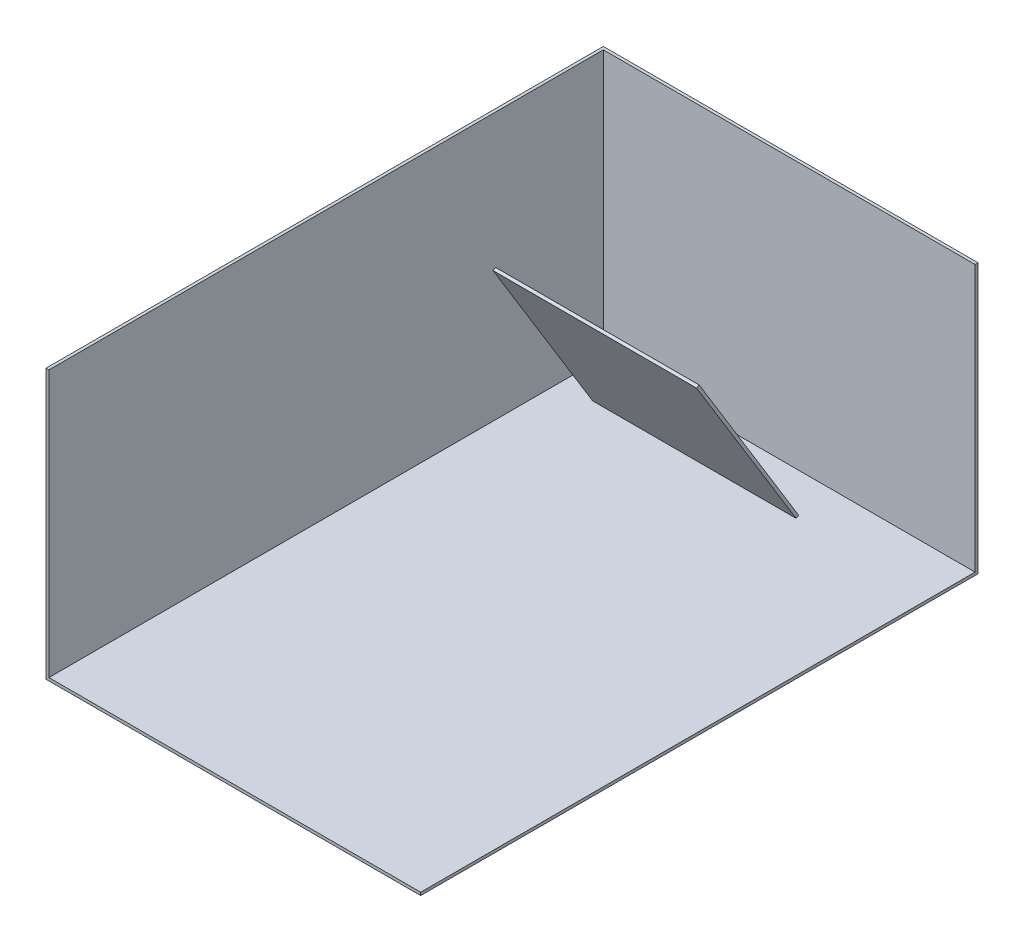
ISO-10303-21;
HEADER;
FILE_DESCRIPTION(('STEP AP214'),'2;1');
FILE_NAME('part.step','',(''),(''),'','','');
FILE_SCHEMA(('AUTOMOTIVE_DESIGN { 1 0 10303 214 1 1 1 1 }'));
ENDSEC;
DATA;
#1=APPLICATION_CONTEXT('core data for automotive mechanical design processes');
#2=APPLICATION_PROTOCOL_DEFINITION('international standard','automotive_design',2000,#1);
#3=PRODUCT_CONTEXT('',#1,'mechanical');
#4=PRODUCT('Part','Part','',(#3));
#5=PRODUCT_RELATED_PRODUCT_CATEGORY('part','',(#4));
#6=PRODUCT_DEFINITION_FORMATION('','',#4);
#7=PRODUCT_DEFINITION_CONTEXT('part definition',#1,'design');
#8=PRODUCT_DEFINITION('design','',#6,#7);
#9=PRODUCT_DEFINITION_SHAPE('','',#8);
#10=(LENGTH_UNIT() NAMED_UNIT(*) SI_UNIT(.MILLI.,.METRE.));
#11=(NAMED_UNIT(*) PLANE_ANGLE_UNIT() SI_UNIT($,.RADIAN.));
#12=(NAMED_UNIT(*) SI_UNIT($,.STERADIAN.) SOLID_ANGLE_UNIT());
#13=UNCERTAINTY_MEASURE_WITH_UNIT(LENGTH_MEASURE(1.E-05),#10,'distance_accuracy_value','');
#14=(GEOMETRIC_REPRESENTATION_CONTEXT(3) GLOBAL_UNCERTAINTY_ASSIGNED_CONTEXT((#13)) GLOBAL_UNIT_ASSIGNED_CONTEXT((#10,
#11,#12)) REPRESENTATION_CONTEXT('',''));
#15=CARTESIAN_POINT('',(0.,0.,0.));
#16=DIRECTION('',(0.,0.,1.));
#17=DIRECTION('',(1.,0.,0.));
#18=AXIS2_PLACEMENT_3D('',#15,#16,#17);
#19=CARTESIAN_POINT('',(90.0000000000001,64.823094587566,57.9064227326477));
#20=DIRECTION('',(0.,0.52215385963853,-0.852851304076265));
#21=DIRECTION('',(0.,0.852851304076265,0.52215385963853));
#22=AXIS2_PLACEMENT_3D('',#19,#20,#21);
#23=PLANE('',#22);
#24=DIRECTION('',(0.,-0.852851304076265,-0.52215385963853));
#25=VECTOR('',#24,1.);
#26=CARTESIAN_POINT('',(20.,64.823094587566,57.9064227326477));
#27=LINE('',#26,#25);
#28=CARTESIAN_POINT('',(20.,64.823094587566,57.9064227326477));
#29=VERTEX_POINT('',#28);
#30=CARTESIAN_POINT('',(20.,8.910594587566,23.6742798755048));
#31=VERTEX_POINT('',#30);
#32=EDGE_CURVE('E93',#29,#31,#27,.T.);
#33=ORIENTED_EDGE('',*,*,#32,.T.);
#34=DIRECTION('',(-1.,0.,0.));
#35=VECTOR('',#34,1.);
#36=CARTESIAN_POINT('',(90.0000000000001,8.910594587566,23.6742798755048));
#37=LINE('',#36,#35);
#38=CARTESIAN_POINT('',(90.0000000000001,8.910594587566,23.6742798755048));
#39=VERTEX_POINT('',#38);
#40=EDGE_CURVE('E12',#39,#31,#37,.T.);
#41=ORIENTED_EDGE('',*,*,#40,.F.);
#42=DIRECTION('',(0.,-0.852851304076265,-0.52215385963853));
#43=VECTOR('',#42,1.);
#44=CARTESIAN_POINT('',(90.0000000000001,64.823094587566,57.9064227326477));
#45=LINE('',#44,#43);
#46=CARTESIAN_POINT('',(90.0000000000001,64.823094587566,57.9064227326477));
#47=VERTEX_POINT('',#46);
#48=EDGE_CURVE('E104',#47,#39,#45,.T.);
#49=ORIENTED_EDGE('',*,*,#48,.F.);
#50=DIRECTION('',(-1.,0.,0.));
#51=VECTOR('',#50,1.);
#52=CARTESIAN_POINT('',(90.0000000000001,64.823094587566,57.9064227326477));
#53=LINE('',#52,#51);
#54=EDGE_CURVE('E56',#47,#29,#53,.T.);
#55=ORIENTED_EDGE('',*,*,#54,.T.);
#56=EDGE_LOOP('',(#33,#41,#49,#55));
#57=FACE_BOUND('',#56,.T.);
#58=ADVANCED_FACE('F42',(#57),#23,.F.);
#59=CARTESIAN_POINT('',(90.0000000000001,9.43274844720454,22.8214285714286));
#60=DIRECTION('',(0.,-0.852851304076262,-0.522153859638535));
#61=DIRECTION('',(0.,0.522153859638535,-0.852851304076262));
#62=AXIS2_PLACEMENT_3D('',#59,#60,#61);
#63=PLANE('',#62);
#64=DIRECTION('',(0.,-0.522153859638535,0.852851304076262));
#65=VECTOR('',#64,1.);
#66=CARTESIAN_POINT('',(20.,9.43274844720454,22.8214285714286));
#67=LINE('',#66,#65);
#68=CARTESIAN_POINT('',(20.,9.43274844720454,22.8214285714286));
#69=VERTEX_POINT('',#68);
#70=EDGE_CURVE('E87',#69,#31,#67,.T.);
#71=ORIENTED_EDGE('',*,*,#70,.F.);
#72=DIRECTION('',(-1.,0.,0.));
#73=VECTOR('',#72,1.);
#74=CARTESIAN_POINT('',(90.0000000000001,9.43274844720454,22.8214285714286));
#75=LINE('',#74,#73);
#76=CARTESIAN_POINT('',(90.0000000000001,9.43274844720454,22.8214285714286));
#77=VERTEX_POINT('',#76);
#78=EDGE_CURVE('E49',#77,#69,#75,.T.);
#79=ORIENTED_EDGE('',*,*,#78,.F.);
#80=DIRECTION('',(0.,-0.522153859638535,0.852851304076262));
#81=VECTOR('',#80,1.);
#82=CARTESIAN_POINT('',(90.0000000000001,9.43274844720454,22.8214285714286));
#83=LINE('',#82,#81);
#84=EDGE_CURVE('E90',#77,#39,#83,.T.);
#85=ORIENTED_EDGE('',*,*,#84,.T.);
#86=ORIENTED_EDGE('',*,*,#40,.T.);
#87=EDGE_LOOP('',(#71,#79,#85,#86));
#88=FACE_BOUND('',#87,.T.);
#89=ADVANCED_FACE('F85',(#88),#63,.T.);
#90=CARTESIAN_POINT('',(90.0000000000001,65.3452484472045,57.0535714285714));
#91=DIRECTION('',(0.,0.52215385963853,-0.852851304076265));
#92=DIRECTION('',(0.,0.852851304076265,0.52215385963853));
#93=AXIS2_PLACEMENT_3D('',#90,#91,#92);
#94=PLANE('',#93);
#95=DIRECTION('',(0.,-0.852851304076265,-0.52215385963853));
#96=VECTOR('',#95,1.);
#97=CARTESIAN_POINT('',(20.,65.3452484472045,57.0535714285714));
#98=LINE('',#97,#96);
#99=CARTESIAN_POINT('',(20.,65.3452484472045,57.0535714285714));
#100=VERTEX_POINT('',#99);
#101=EDGE_CURVE('E98',#100,#69,#98,.T.);
#102=ORIENTED_EDGE('',*,*,#101,.F.);
#103=DIRECTION('',(-1.,0.,0.));
#104=VECTOR('',#103,1.);
#105=CARTESIAN_POINT('',(90.0000000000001,65.3452484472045,57.0535714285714));
#106=LINE('',#105,#104);
#107=CARTESIAN_POINT('',(90.0000000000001,65.3452484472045,57.0535714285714));
#108=VERTEX_POINT('',#107);
#109=EDGE_CURVE('E64',#108,#100,#106,.T.);
#110=ORIENTED_EDGE('',*,*,#109,.F.);
#111=DIRECTION('',(0.,-0.852851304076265,-0.52215385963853));
#112=VECTOR('',#111,1.);
#113=CARTESIAN_POINT('',(90.0000000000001,65.3452484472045,57.0535714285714));
#114=LINE('',#113,#112);
#115=EDGE_CURVE('E107',#108,#77,#114,.T.);
#116=ORIENTED_EDGE('',*,*,#115,.T.);
#117=ORIENTED_EDGE('',*,*,#78,.T.);
#118=EDGE_LOOP('',(#102,#110,#116,#117));
#119=FACE_BOUND('',#118,.T.);
#120=ADVANCED_FACE('F112',(#119),#94,.T.);
#121=CARTESIAN_POINT('',(90.0000000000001,64.823094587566,57.9064227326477));
#122=DIRECTION('',(0.,0.852851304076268,0.522153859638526));
#123=DIRECTION('',(0.,-0.522153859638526,0.852851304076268));
#124=AXIS2_PLACEMENT_3D('',#121,#122,#123);
#125=PLANE('',#124);
#126=DIRECTION('',(0.,0.522153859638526,-0.852851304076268));
#127=VECTOR('',#126,1.);
#128=CARTESIAN_POINT('',(20.,64.823094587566,57.9064227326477));
#129=LINE('',#128,#127);
#130=EDGE_CURVE('E100',#29,#100,#129,.T.);
#131=ORIENTED_EDGE('',*,*,#130,.F.);
#132=ORIENTED_EDGE('',*,*,#54,.F.);
#133=DIRECTION('',(0.,0.522153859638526,-0.852851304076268));
#134=VECTOR('',#133,1.);
#135=CARTESIAN_POINT('',(90.0000000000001,64.823094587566,57.9064227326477));
#136=LINE('',#135,#134);
#137=EDGE_CURVE('E109',#47,#108,#136,.T.);
#138=ORIENTED_EDGE('',*,*,#137,.T.);
#139=ORIENTED_EDGE('',*,*,#109,.T.);
#140=EDGE_LOOP('',(#131,#132,#138,#139));
#141=FACE_BOUND('',#140,.T.);
#142=ADVANCED_FACE('F116',(#141),#125,.T.);
#143=CARTESIAN_POINT('',(90.0000000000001,64.823094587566,57.9064227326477));
#144=DIRECTION('',(1.,0.,0.));
#145=DIRECTION('',(0.,0.,-1.));
#146=AXIS2_PLACEMENT_3D('',#143,#144,#145);
#147=PLANE('',#146);
#148=ORIENTED_EDGE('',*,*,#48,.T.);
#149=ORIENTED_EDGE('',*,*,#84,.F.);
#150=ORIENTED_EDGE('',*,*,#115,.F.);
#151=ORIENTED_EDGE('',*,*,#137,.F.);
#152=EDGE_LOOP('',(#148,#149,#150,#151));
#153=FACE_BOUND('',#152,.T.);
#154=ADVANCED_FACE('F114',(#153),#147,.T.);
#155=CARTESIAN_POINT('',(20.,64.823094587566,57.9064227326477));
#156=DIRECTION('',(1.,0.,0.));
#157=DIRECTION('',(0.,0.,-1.));
#158=AXIS2_PLACEMENT_3D('',#155,#156,#157);
#159=PLANE('',#158);
#160=ORIENTED_EDGE('',*,*,#32,.F.);
#161=ORIENTED_EDGE('',*,*,#130,.T.);
#162=ORIENTED_EDGE('',*,*,#101,.T.);
#163=ORIENTED_EDGE('',*,*,#70,.T.);
#164=EDGE_LOOP('',(#160,#161,#162,#163));
#165=FACE_BOUND('',#164,.T.);
#166=ADVANCED_FACE('F97',(#165),#159,.F.);
#167=CLOSED_SHELL('',(#58,#89,#120,#142,#154,#166));
#168=MANIFOLD_SOLID_BREP('B2',#167);
#169=CARTESIAN_POINT('',(128.877391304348,0.,191.7));
#170=DIRECTION('',(-1.,0.,0.));
#171=DIRECTION('',(0.,0.,1.));
#172=AXIS2_PLACEMENT_3D('',#169,#170,#171);
#173=PLANE('',#172);
#174=DIRECTION('',(0.,1.,0.));
#175=VECTOR('',#174,1.);
#176=CARTESIAN_POINT('',(128.877391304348,92.6547826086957,1.));
#177=LINE('',#176,#175);
#178=CARTESIAN_POINT('',(128.877391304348,1.,1.));
#179=VERTEX_POINT('',#178);
#180=CARTESIAN_POINT('',(128.877391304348,92.6547826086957,1.));
#181=VERTEX_POINT('',#180);
#182=EDGE_CURVE('E225',#179,#181,#177,.T.);
#183=ORIENTED_EDGE('',*,*,#182,.F.);
#184=DIRECTION('',(0.,0.,-1.));
#185=VECTOR('',#184,1.);
#186=CARTESIAN_POINT('',(128.877391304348,1.,191.7));
#187=LINE('',#186,#185);
#188=CARTESIAN_POINT('',(128.877391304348,1.,191.7));
#189=VERTEX_POINT('',#188);
#190=EDGE_CURVE('E221',#189,#179,#187,.T.);
#191=ORIENTED_EDGE('',*,*,#190,.F.);
#192=DIRECTION('',(0.,1.,0.));
#193=VECTOR('',#192,1.);
#194=CARTESIAN_POINT('',(128.877391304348,0.,191.7));
#195=LINE('',#194,#193);
#196=CARTESIAN_POINT('',(128.877391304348,0.,191.7));
#197=VERTEX_POINT('',#196);
#198=EDGE_CURVE('E262',#197,#189,#195,.T.);
#199=ORIENTED_EDGE('',*,*,#198,.F.);
#200=DIRECTION('',(0.,0.,-1.));
#201=VECTOR('',#200,1.);
#202=CARTESIAN_POINT('',(128.877391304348,0.,191.7));
#203=LINE('',#202,#201);
#204=CARTESIAN_POINT('',(128.877391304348,0.,0.));
#205=VERTEX_POINT('',#204);
#206=EDGE_CURVE('E167',#197,#205,#203,.T.);
#207=ORIENTED_EDGE('',*,*,#206,.T.);
#208=DIRECTION('',(0.,1.,0.));
#209=VECTOR('',#208,1.);
#210=CARTESIAN_POINT('',(128.877391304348,0.,0.));
#211=LINE('',#210,#209);
#212=CARTESIAN_POINT('',(128.877391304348,92.6547826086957,0.));
#213=VERTEX_POINT('',#212);
#214=EDGE_CURVE('E253',#205,#213,#211,.T.);
#215=ORIENTED_EDGE('',*,*,#214,.T.);
#216=DIRECTION('',(0.,0.,-1.));
#217=VECTOR('',#216,1.);
#218=CARTESIAN_POINT('',(128.877391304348,92.6547826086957,191.7));
#219=LINE('',#218,#217);
#220=EDGE_CURVE('E269',#181,#213,#219,.T.);
#221=ORIENTED_EDGE('',*,*,#220,.F.);
#222=EDGE_LOOP('',(#183,#191,#199,#207,#215,#221));
#223=FACE_BOUND('',#222,.T.);
#224=ADVANCED_FACE('F159',(#223),#173,.F.);
#225=CARTESIAN_POINT('',(0.,92.6547826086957,191.7));
#226=DIRECTION('',(0.,-1.,0.));
#227=DIRECTION('',(0.,0.,-1.));
#228=AXIS2_PLACEMENT_3D('',#225,#226,#227);
#229=PLANE('',#228);
#230=DIRECTION('',(-1.,0.,0.));
#231=VECTOR('',#230,1.);
#232=CARTESIAN_POINT('',(0.,92.6547826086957,1.));
#233=LINE('',#232,#231);
#234=CARTESIAN_POINT('',(1.,92.6547826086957,1.));
#235=VERTEX_POINT('',#234);
#236=EDGE_CURVE('E238',#181,#235,#233,.T.);
#237=ORIENTED_EDGE('',*,*,#236,.F.);
#238=ORIENTED_EDGE('',*,*,#220,.T.);
#239=DIRECTION('',(-1.,0.,0.));
#240=VECTOR('',#239,1.);
#241=CARTESIAN_POINT('',(0.,92.6547826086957,0.));
#242=LINE('',#241,#240);
#243=CARTESIAN_POINT('',(0.,92.6547826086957,0.));
#244=VERTEX_POINT('',#243);
#245=EDGE_CURVE('E256',#213,#244,#242,.T.);
#246=ORIENTED_EDGE('',*,*,#245,.T.);
#247=DIRECTION('',(0.,0.,-1.));
#248=VECTOR('',#247,1.);
#249=CARTESIAN_POINT('',(0.,92.6547826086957,191.7));
#250=LINE('',#249,#248);
#251=CARTESIAN_POINT('',(0.,92.6547826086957,191.7));
#252=VERTEX_POINT('',#251);
#253=EDGE_CURVE('E266',#252,#244,#250,.T.);
#254=ORIENTED_EDGE('',*,*,#253,.F.);
#255=DIRECTION('',(-1.,0.,0.));
#256=VECTOR('',#255,1.);
#257=CARTESIAN_POINT('',(0.,92.6547826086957,191.7));
#258=LINE('',#257,#256);
#259=CARTESIAN_POINT('',(1.,92.6547826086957,191.7));
#260=VERTEX_POINT('',#259);
#261=EDGE_CURVE('E182',#260,#252,#258,.T.);
#262=ORIENTED_EDGE('',*,*,#261,.F.);
#263=DIRECTION('',(0.,0.,-1.));
#264=VECTOR('',#263,1.);
#265=CARTESIAN_POINT('',(1.,92.6547826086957,191.7));
#266=LINE('',#265,#264);
#267=EDGE_CURVE('E244',#260,#235,#266,.T.);
#268=ORIENTED_EDGE('',*,*,#267,.T.);
#269=EDGE_LOOP('',(#237,#238,#246,#254,#262,#268));
#270=FACE_BOUND('',#269,.T.);
#271=ADVANCED_FACE('F282',(#270),#229,.F.);
#272=CARTESIAN_POINT('',(0.,92.6547826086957,191.7));
#273=DIRECTION('',(0.,0.,-1.));
#274=DIRECTION('',(-1.,0.,0.));
#275=AXIS2_PLACEMENT_3D('',#272,#273,#274);
#276=PLANE('',#275);
#277=DIRECTION('',(0.,-1.,0.));
#278=VECTOR('',#277,1.);
#279=CARTESIAN_POINT('',(1.,92.6547826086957,191.7));
#280=LINE('',#279,#278);
#281=CARTESIAN_POINT('',(1.,1.,191.7));
#282=VERTEX_POINT('',#281);
#283=EDGE_CURVE('E232',#260,#282,#280,.T.);
#284=ORIENTED_EDGE('',*,*,#283,.F.);
#285=ORIENTED_EDGE('',*,*,#261,.T.);
#286=DIRECTION('',(0.,-1.,0.));
#287=VECTOR('',#286,1.);
#288=CARTESIAN_POINT('',(0.,0.,191.7));
#289=LINE('',#288,#287);
#290=CARTESIAN_POINT('',(0.,0.,191.7));
#291=VERTEX_POINT('',#290);
#292=EDGE_CURVE('E258',#252,#291,#289,.T.);
#293=ORIENTED_EDGE('',*,*,#292,.T.);
#294=DIRECTION('',(1.,0.,0.));
#295=VECTOR('',#294,1.);
#296=CARTESIAN_POINT('',(0.,0.,191.7));
#297=LINE('',#296,#295);
#298=EDGE_CURVE('E260',#291,#197,#297,.T.);
#299=ORIENTED_EDGE('',*,*,#298,.T.);
#300=ORIENTED_EDGE('',*,*,#198,.T.);
#301=DIRECTION('',(1.,0.,0.));
#302=VECTOR('',#301,1.);
#303=CARTESIAN_POINT('',(0.,1.,191.7));
#304=LINE('',#303,#302);
#305=EDGE_CURVE('E242',#282,#189,#304,.T.);
#306=ORIENTED_EDGE('',*,*,#305,.F.);
#307=EDGE_LOOP('',(#284,#285,#293,#299,#300,#306));
#308=FACE_BOUND('',#307,.T.);
#309=ADVANCED_FACE('F286',(#308),#276,.F.);
#310=CARTESIAN_POINT('',(0.,0.,191.7));
#311=DIRECTION('',(1.,0.,0.));
#312=DIRECTION('',(0.,0.,-1.));
#313=AXIS2_PLACEMENT_3D('',#310,#311,#312);
#314=PLANE('',#313);
#315=DIRECTION('',(0.,-1.,0.));
#316=VECTOR('',#315,1.);
#317=CARTESIAN_POINT('',(0.,0.,0.));
#318=LINE('',#317,#316);
#319=CARTESIAN_POINT('',(0.,0.,0.));
#320=VERTEX_POINT('',#319);
#321=EDGE_CURVE('E234',#244,#320,#318,.T.);
#322=ORIENTED_EDGE('',*,*,#321,.T.);
#323=DIRECTION('',(0.,0.,-1.));
#324=VECTOR('',#323,1.);
#325=CARTESIAN_POINT('',(0.,0.,191.7));
#326=LINE('',#325,#324);
#327=EDGE_CURVE('E40',#291,#320,#326,.T.);
#328=ORIENTED_EDGE('',*,*,#327,.F.);
#329=ORIENTED_EDGE('',*,*,#292,.F.);
#330=ORIENTED_EDGE('',*,*,#253,.T.);
#331=EDGE_LOOP('',(#322,#328,#329,#330));
#332=FACE_BOUND('',#331,.T.);
#333=ADVANCED_FACE('F161',(#332),#314,.F.);
#334=CARTESIAN_POINT('',(0.,0.,191.7));
#335=DIRECTION('',(0.,1.,0.));
#336=DIRECTION('',(0.,0.,1.));
#337=AXIS2_PLACEMENT_3D('',#334,#335,#336);
#338=PLANE('',#337);
#339=DIRECTION('',(1.,0.,0.));
#340=VECTOR('',#339,1.);
#341=CARTESIAN_POINT('',(0.,0.,0.));
#342=LINE('',#341,#340);
#343=EDGE_CURVE('E251',#320,#205,#342,.T.);
#344=ORIENTED_EDGE('',*,*,#343,.T.);
#345=ORIENTED_EDGE('',*,*,#206,.F.);
#346=ORIENTED_EDGE('',*,*,#298,.F.);
#347=ORIENTED_EDGE('',*,*,#327,.T.);
#348=EDGE_LOOP('',(#344,#345,#346,#347));
#349=FACE_BOUND('',#348,.T.);
#350=ADVANCED_FACE('F287',(#349),#338,.F.);
#351=CARTESIAN_POINT('',(0.,92.6547826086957,0.));
#352=DIRECTION('',(0.,0.,-1.));
#353=DIRECTION('',(-1.,0.,0.));
#354=AXIS2_PLACEMENT_3D('',#351,#352,#353);
#355=PLANE('',#354);
#356=ORIENTED_EDGE('',*,*,#321,.F.);
#357=ORIENTED_EDGE('',*,*,#245,.F.);
#358=ORIENTED_EDGE('',*,*,#214,.F.);
#359=ORIENTED_EDGE('',*,*,#343,.F.);
#360=EDGE_LOOP('',(#356,#357,#358,#359));
#361=FACE_BOUND('',#360,.T.);
#362=ADVANCED_FACE('F280',(#361),#355,.T.);
#363=CARTESIAN_POINT('',(1.,0.,191.7));
#364=DIRECTION('',(1.,0.,0.));
#365=DIRECTION('',(0.,0.,-1.));
#366=AXIS2_PLACEMENT_3D('',#363,#364,#365);
#367=PLANE('',#366);
#368=DIRECTION('',(0.,-1.,0.));
#369=VECTOR('',#368,1.);
#370=CARTESIAN_POINT('',(1.,92.6547826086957,1.));
#371=LINE('',#370,#369);
#372=CARTESIAN_POINT('',(1.,1.,1.));
#373=VERTEX_POINT('',#372);
#374=EDGE_CURVE('E226',#235,#373,#371,.T.);
#375=ORIENTED_EDGE('',*,*,#374,.F.);
#376=ORIENTED_EDGE('',*,*,#267,.F.);
#377=ORIENTED_EDGE('',*,*,#283,.T.);
#378=DIRECTION('',(0.,0.,-1.));
#379=VECTOR('',#378,1.);
#380=CARTESIAN_POINT('',(1.,1.,191.7));
#381=LINE('',#380,#379);
#382=EDGE_CURVE('E174',#282,#373,#381,.T.);
#383=ORIENTED_EDGE('',*,*,#382,.T.);
#384=EDGE_LOOP('',(#375,#376,#377,#383));
#385=FACE_BOUND('',#384,.T.);
#386=ADVANCED_FACE('F230',(#385),#367,.T.);
#387=CARTESIAN_POINT('',(0.,1.,191.7));
#388=DIRECTION('',(0.,1.,0.));
#389=DIRECTION('',(0.,0.,1.));
#390=AXIS2_PLACEMENT_3D('',#387,#388,#389);
#391=PLANE('',#390);
#392=DIRECTION('',(1.,0.,0.));
#393=VECTOR('',#392,1.);
#394=CARTESIAN_POINT('',(0.,1.,1.));
#395=LINE('',#394,#393);
#396=EDGE_CURVE('E218',#373,#179,#395,.T.);
#397=ORIENTED_EDGE('',*,*,#396,.F.);
#398=ORIENTED_EDGE('',*,*,#382,.F.);
#399=ORIENTED_EDGE('',*,*,#305,.T.);
#400=ORIENTED_EDGE('',*,*,#190,.T.);
#401=EDGE_LOOP('',(#397,#398,#399,#400));
#402=FACE_BOUND('',#401,.T.);
#403=ADVANCED_FACE('F219',(#402),#391,.T.);
#404=CARTESIAN_POINT('',(0.,92.6547826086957,1.));
#405=DIRECTION('',(0.,0.,-1.));
#406=DIRECTION('',(-1.,0.,0.));
#407=AXIS2_PLACEMENT_3D('',#404,#405,#406);
#408=PLANE('',#407);
#409=ORIENTED_EDGE('',*,*,#374,.T.);
#410=ORIENTED_EDGE('',*,*,#396,.T.);
#411=ORIENTED_EDGE('',*,*,#182,.T.);
#412=ORIENTED_EDGE('',*,*,#236,.T.);
#413=EDGE_LOOP('',(#409,#410,#411,#412));
#414=FACE_BOUND('',#413,.T.);
#415=ADVANCED_FACE('F236',(#414),#408,.F.);
#416=CLOSED_SHELL('',(#224,#271,#309,#333,#350,#362,#386,#403,#415));
#417=MANIFOLD_SOLID_BREP('B6',#416);
#418=ADVANCED_BREP_SHAPE_REPRESENTATION('',(#18,#168,#417),#14);
#419=SHAPE_DEFINITION_REPRESENTATION(#9,#418);
ENDSEC;
END-ISO-10303-21;
